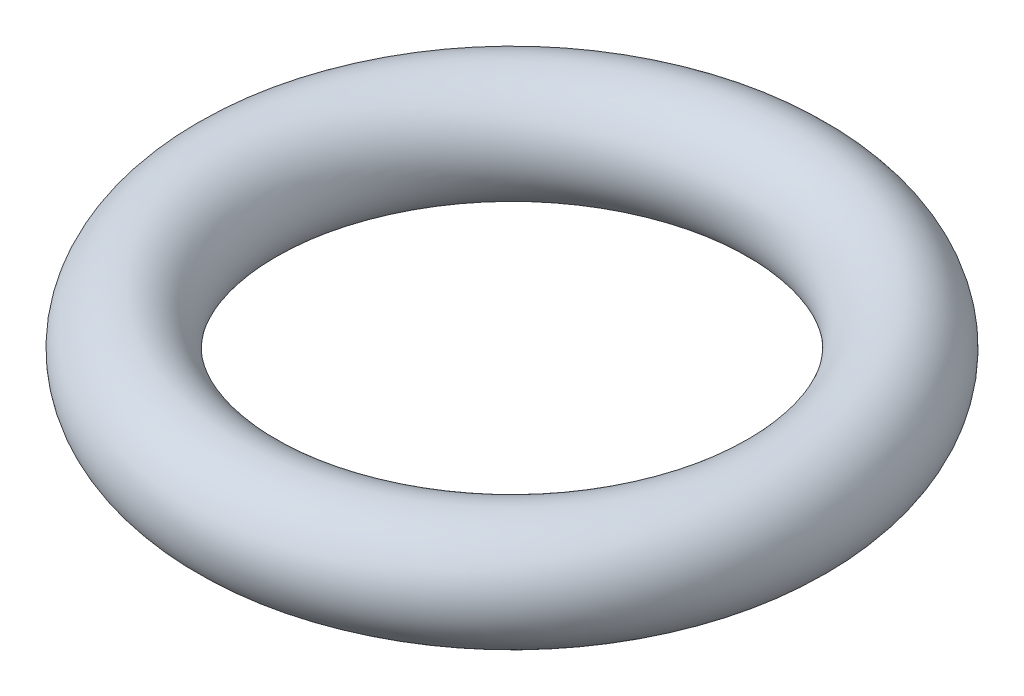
from build123d import *

# Parameters (mm, degrees)
SKIZZE1_R = 0.5


with BuildPart() as part:
    # Skizze1 → Rotation1 (revolve)
    with BuildSketch(Plane.XY):
        with Locations((-2.5, 0.5)):
            Circle(SKIZZE1_R)
    revolve(axis=Axis((0, 11.490245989, 0), (0, -1, 0)))


solid = part.part
